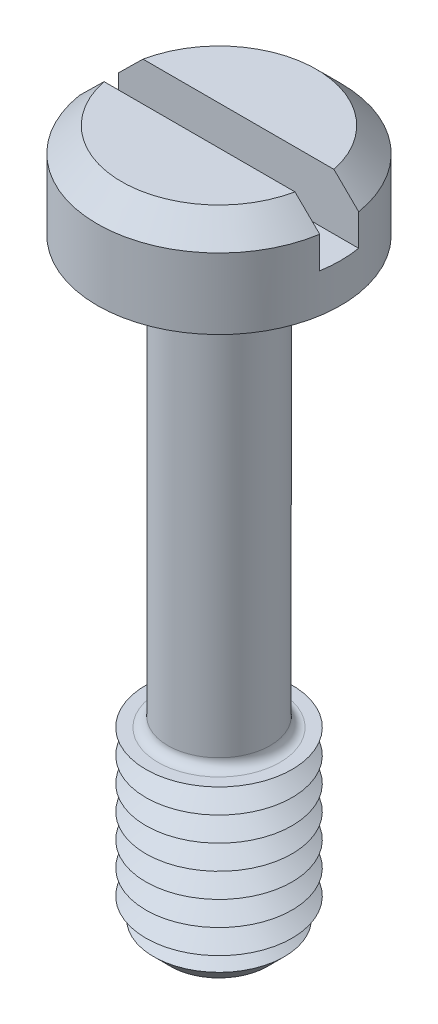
ISO-10303-21;
HEADER;
FILE_DESCRIPTION(('STEP AP214'),'2;1');
FILE_NAME('part.step','',(''),(''),'','','');
FILE_SCHEMA(('AUTOMOTIVE_DESIGN { 1 0 10303 214 1 1 1 1 }'));
ENDSEC;
DATA;
#1=APPLICATION_CONTEXT('core data for automotive mechanical design processes');
#2=APPLICATION_PROTOCOL_DEFINITION('international standard','automotive_design',2000,#1);
#3=PRODUCT_CONTEXT('',#1,'mechanical');
#4=PRODUCT('Part','Part','',(#3));
#5=PRODUCT_RELATED_PRODUCT_CATEGORY('part','',(#4));
#6=PRODUCT_DEFINITION_FORMATION('','',#4);
#7=PRODUCT_DEFINITION_CONTEXT('part definition',#1,'design');
#8=PRODUCT_DEFINITION('design','',#6,#7);
#9=PRODUCT_DEFINITION_SHAPE('','',#8);
#10=(LENGTH_UNIT() NAMED_UNIT(*) SI_UNIT(.MILLI.,.METRE.));
#11=(NAMED_UNIT(*) PLANE_ANGLE_UNIT() SI_UNIT($,.RADIAN.));
#12=(NAMED_UNIT(*) SI_UNIT($,.STERADIAN.) SOLID_ANGLE_UNIT());
#13=UNCERTAINTY_MEASURE_WITH_UNIT(LENGTH_MEASURE(1.E-05),#10,'distance_accuracy_value','');
#14=(GEOMETRIC_REPRESENTATION_CONTEXT(3) GLOBAL_UNCERTAINTY_ASSIGNED_CONTEXT((#13)) GLOBAL_UNIT_ASSIGNED_CONTEXT((#10,
#11,#12)) REPRESENTATION_CONTEXT('',''));
#15=CARTESIAN_POINT('',(0.,0.,0.));
#16=DIRECTION('',(0.,0.,1.));
#17=DIRECTION('',(1.,0.,0.));
#18=AXIS2_PLACEMENT_3D('',#15,#16,#17);
#19=CARTESIAN_POINT('',(0.,3.9,0.));
#20=DIRECTION('',(0.,1.,0.));
#21=DIRECTION('',(0.,0.,1.));
#22=AXIS2_PLACEMENT_3D('',#19,#20,#21);
#23=PLANE('',#22);
#24=DIRECTION('',(-1.,0.,0.));
#25=VECTOR('',#24,1.);
#26=CARTESIAN_POINT('',(5.,3.9,-0.8));
#27=LINE('',#26,#25);
#28=CARTESIAN_POINT('',(3.91918358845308,3.9,-0.8));
#29=VERTEX_POINT('',#28);
#30=CARTESIAN_POINT('',(-3.91918358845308,3.9,-0.8));
#31=VERTEX_POINT('',#30);
#32=EDGE_CURVE('E110',#29,#31,#27,.T.);
#33=ORIENTED_EDGE('',*,*,#32,.F.);
#34=CARTESIAN_POINT('',(0.,3.9,0.));
#35=DIRECTION('',(0.,1.,0.));
#36=DIRECTION('',(0.,0.,1.));
#37=AXIS2_PLACEMENT_3D('',#34,#35,#36);
#38=CIRCLE('',#37,4.);
#39=EDGE_CURVE('E113',#29,#31,#38,.T.);
#40=ORIENTED_EDGE('',*,*,#39,.T.);
#41=EDGE_LOOP('',(#33,#40));
#42=FACE_BOUND('',#41,.T.);
#43=ADVANCED_FACE('F39',(#42),#23,.T.);
#44=CARTESIAN_POINT('',(0.,3.9,0.));
#45=DIRECTION('',(0.,-1.,0.));
#46=DIRECTION('',(0.,0.,-1.));
#47=AXIS2_PLACEMENT_3D('',#44,#45,#46);
#48=CONICAL_SURFACE('',#47,4.,0.785398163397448);
#49=CARTESIAN_POINT('',(11.0010756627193,-3.13012537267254,-0.8));
#50=CARTESIAN_POINT('',(10.6180645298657,-2.74813121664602,-0.8));
#51=CARTESIAN_POINT('',(10.2350087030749,-2.36618183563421,-0.8));
#52=CARTESIAN_POINT('',(9.46873746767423,-1.60241986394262,-0.8));
#53=CARTESIAN_POINT('',(9.08552205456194,-1.2206072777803,-0.8));
#54=CARTESIAN_POINT('',(8.31861292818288,-0.45691870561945,-0.8));
#55=CARTESIAN_POINT('',(7.93491906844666,-0.0750428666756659,-0.8));
#56=CARTESIAN_POINT('',(7.16722555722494,0.68837857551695,-0.8));
#57=CARTESIAN_POINT('',(6.78322591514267,1.06992418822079,-0.8));
#58=CARTESIAN_POINT('',(6.01856215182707,1.82868912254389,-0.8));
#59=CARTESIAN_POINT('',(5.63790309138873,2.20591354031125,-0.8));
#60=CARTESIAN_POINT('',(5.06622054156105,2.77108317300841,-0.8));
#61=CARTESIAN_POINT('',(4.87553531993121,2.95937045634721,-0.8));
#62=CARTESIAN_POINT('',(4.49384424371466,3.33561647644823,-0.8));
#63=CARTESIAN_POINT('',(4.30283839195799,3.52357521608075,-0.8));
#64=CARTESIAN_POINT('',(3.92044271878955,3.89893397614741,-0.8));
#65=CARTESIAN_POINT('',(3.7290531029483,4.08633420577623,-0.8));
#66=CARTESIAN_POINT('',(3.34554223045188,4.46039762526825,-0.8));
#67=CARTESIAN_POINT('',(3.15342094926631,4.64706078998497,-0.8));
#68=CARTESIAN_POINT('',(2.76802565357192,5.01913697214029,-0.8));
#69=CARTESIAN_POINT('',(2.57475182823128,5.2045501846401,-0.8));
#70=CARTESIAN_POINT('',(2.28318236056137,5.48091108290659,-0.8));
#71=CARTESIAN_POINT('',(2.18571873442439,5.57273577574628,-0.8));
#72=CARTESIAN_POINT('',(1.98998431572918,5.75552004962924,-0.8));
#73=CARTESIAN_POINT('',(1.89171354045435,5.84647964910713,-0.8));
#74=CARTESIAN_POINT('',(1.76578543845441,5.96147491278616,-0.8));
#75=CARTESIAN_POINT('',(1.73869031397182,5.98612635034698,-0.8));
#76=CARTESIAN_POINT('',(1.68439529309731,6.03531372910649,-0.8));
#77=CARTESIAN_POINT('',(1.65719539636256,6.05984966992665,-0.8));
#78=CARTESIAN_POINT('',(1.57541627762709,6.13326356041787,-0.8));
#79=CARTESIAN_POINT('',(1.52066027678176,6.18194515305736,-0.8));
#80=CARTESIAN_POINT('',(1.41038257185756,6.27874171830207,-0.8));
#81=CARTESIAN_POINT('',(1.35485918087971,6.32685477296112,-0.8));
#82=CARTESIAN_POINT('',(1.24299231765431,6.42210730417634,-0.8));
#83=CARTESIAN_POINT('',(1.18664895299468,6.46924690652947,-0.8));
#84=CARTESIAN_POINT('',(1.07845249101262,6.55754663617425,-0.8));
#85=CARTESIAN_POINT('',(1.02670624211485,6.59883713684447,-0.8));
#86=CARTESIAN_POINT('',(0.921961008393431,6.67979338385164,-0.8));
#87=CARTESIAN_POINT('',(0.868962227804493,6.71945939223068,-0.8));
#88=CARTESIAN_POINT('',(0.761295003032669,6.79630361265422,-0.8));
#89=CARTESIAN_POINT('',(0.706629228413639,6.83348552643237,-0.8));
#90=CARTESIAN_POINT('',(0.594896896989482,6.90399895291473,-0.8));
#91=CARTESIAN_POINT('',(0.537833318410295,6.93733506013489,-0.8));
#92=CARTESIAN_POINT('',(0.42839047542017,6.99356340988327,-0.8));
#93=CARTESIAN_POINT('',(0.376435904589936,7.01726022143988,-0.8));
#94=CARTESIAN_POINT('',(0.269759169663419,7.05717670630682,-0.8));
#95=CARTESIAN_POINT('',(0.215046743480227,7.07342088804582,-0.8));
#96=CARTESIAN_POINT('',(0.113016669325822,7.09332110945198,-0.8));
#97=CARTESIAN_POINT('',(0.0660435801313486,7.09866042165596,-0.8));
#98=CARTESIAN_POINT('',(-0.0280587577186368,7.10088875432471,-0.8));
#99=CARTESIAN_POINT('',(-0.0751877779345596,7.09778705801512,-0.8));
#100=CARTESIAN_POINT('',(-0.180723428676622,7.08192474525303,-0.8));
#101=CARTESIAN_POINT('',(-0.238762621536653,7.06679554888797,-0.8));
#102=CARTESIAN_POINT('',(-0.32349937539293,7.03748409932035,-0.8));
#103=CARTESIAN_POINT('',(-0.351441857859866,7.02656594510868,-0.8));
#104=CARTESIAN_POINT('',(-0.406569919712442,7.00295901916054,-0.8));
#105=CARTESIAN_POINT('',(-0.433755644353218,6.99027059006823,-0.8));
#106=CARTESIAN_POINT('',(-0.5046737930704,6.95489235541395,-0.8));
#107=CARTESIAN_POINT('',(-0.547808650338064,6.93101671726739,-0.8));
#108=CARTESIAN_POINT('',(-0.632566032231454,6.88069648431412,-0.8));
#109=CARTESIAN_POINT('',(-0.674187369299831,6.85424992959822,-0.8));
#110=CARTESIAN_POINT('',(-0.756326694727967,6.79950439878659,-0.8));
#111=CARTESIAN_POINT('',(-0.796841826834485,6.77120117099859,-0.8));
#112=CARTESIAN_POINT('',(-0.876938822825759,6.7132985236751,-0.8));
#113=CARTESIAN_POINT('',(-0.916520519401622,6.68369887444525,-0.8));
#114=CARTESIAN_POINT('',(-1.03465904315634,6.59312324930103,-0.8));
#115=CARTESIAN_POINT('',(-1.11211338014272,6.53071425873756,-0.8));
#116=CARTESIAN_POINT('',(-1.26505454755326,6.4038141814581,-0.8));
#117=CARTESIAN_POINT('',(-1.34054439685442,6.33932667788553,-0.8));
#118=CARTESIAN_POINT('',(-1.48913173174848,6.20997083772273,-0.8));
#119=CARTESIAN_POINT('',(-1.56224816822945,6.14512422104,-0.8));
#120=CARTESIAN_POINT('',(-1.70765393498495,6.01451044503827,-0.8));
#121=CARTESIAN_POINT('',(-1.77994324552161,5.94874326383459,-0.8));
#122=CARTESIAN_POINT('',(-1.99594639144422,5.7504659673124,-0.8));
#123=CARTESIAN_POINT('',(-2.13877767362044,5.61699583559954,-0.8));
#124=CARTESIAN_POINT('',(-2.42324632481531,5.34853800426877,-0.8));
#125=CARTESIAN_POINT('',(-2.56488247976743,5.21354902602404,-0.8));
#126=CARTESIAN_POINT('',(-2.8473092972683,4.94270932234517,-0.8));
#127=CARTESIAN_POINT('',(-2.98810001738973,4.80685865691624,-0.8));
#128=CARTESIAN_POINT('',(-3.26818763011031,4.5354997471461,-0.8));
#129=CARTESIAN_POINT('',(-3.40748821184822,4.39999530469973,-0.8));
#130=CARTESIAN_POINT('',(-3.68570899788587,4.12859172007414,-0.8));
#131=CARTESIAN_POINT('',(-3.82462919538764,3.99269257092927,-0.8));
#132=CARTESIAN_POINT('',(-4.24087543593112,3.58468153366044,-0.8));
#133=CARTESIAN_POINT('',(-4.51779300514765,3.31215310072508,-0.8));
#134=CARTESIAN_POINT('',(-5.05279381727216,2.78443938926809,-0.8));
#135=CARTESIAN_POINT('',(-5.31091639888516,2.52929393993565,-0.8));
#136=CARTESIAN_POINT('',(-5.82680751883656,2.01864429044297,-0.8));
#137=CARTESIAN_POINT('',(-6.08457605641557,1.76314008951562,-0.8));
#138=CARTESIAN_POINT('',(-6.85760508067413,0.996194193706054,-0.8));
#139=CARTESIAN_POINT('',(-7.37251152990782,0.484395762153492,-0.8));
#140=CARTESIAN_POINT('',(-8.40657233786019,-0.544392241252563,-0.8));
#141=CARTESIAN_POINT('',(-8.92572224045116,-1.06138628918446,-0.8));
#142=CARTESIAN_POINT('',(-9.96362871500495,-2.09560660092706,-0.8));
#143=CARTESIAN_POINT('',(-10.4823853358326,-2.61283281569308,-0.8));
#144=CARTESIAN_POINT('',(-11.0010756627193,-3.13012537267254,-0.8));
#145=B_SPLINE_CURVE_WITH_KNOTS('',3,(#49,#50,#51,#52,#53,#54,#55,#56,#57,#58,#59,#60,#61,#62,
#63,#64,#65,#66,#67,#68,#69,#70,#71,#72,#73,#74,#75,#76,#77,#78,#79,#80,#81,#82,#83,#84,#85,#86,
#87,#88,#89,#90,#91,#92,#93,#94,#95,#96,#97,#98,#99,#100,#101,#102,#103,#104,#105,#106,#107,
#108,#109,#110,#111,#112,#113,#114,#115,#116,#117,#118,#119,#120,#121,#122,#123,#124,#125,#126,
#127,#128,#129,#130,#131,#132,#133,#134,#135,#136,#137,#138,#139,#140,#141,#142,#143,#144),
.UNSPECIFIED.,.F.,.F.,(4,2,2,2,2,2,2,2,2,2,2,2,2,2,2,2,2,2,2,2,2,2,2,2,2,2,2,2,2,2,2,2,2,2,2,2,
2,2,2,2,2,2,2,2,2,2,2,4),(0.,1.62282275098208,3.2456948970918,4.869717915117,6.49369278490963,
8.10142191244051,8.90535980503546,9.70929063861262,10.5128682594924,11.3164730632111,
12.1199494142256,12.5216659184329,12.9233738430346,13.0332669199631,13.1431603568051,
13.3629580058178,13.5833578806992,13.8037290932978,14.0023112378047,14.2008612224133,
14.3991084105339,14.5971162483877,14.7680800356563,14.9384774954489,15.0795987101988,
15.2205647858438,15.3993585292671,15.4893211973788,15.5792664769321,15.727032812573,
15.8749126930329,16.0231439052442,16.1714014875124,16.4697244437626,16.7675580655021,
17.0607348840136,17.3539186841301,17.9403574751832,18.5273336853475,19.1142694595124,
19.6972736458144,20.2802881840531,21.4458742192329,22.5346981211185,23.6235243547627,
25.8015035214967,27.9995014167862,30.1971550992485),.UNSPECIFIED.);
#146=CARTESIAN_POINT('',(4.93558507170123,2.9,-0.8));
#147=VERTEX_POINT('',#146);
#148=EDGE_CURVE('E252',#147,#29,#145,.T.);
#149=ORIENTED_EDGE('',*,*,#148,.F.);
#150=CARTESIAN_POINT('',(0.,2.9,0.));
#151=DIRECTION('',(0.,1.,0.));
#152=DIRECTION('',(0.,0.,1.));
#153=AXIS2_PLACEMENT_3D('',#150,#151,#152);
#154=CIRCLE('',#153,5.);
#155=CARTESIAN_POINT('',(-4.93558507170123,2.9,-0.8));
#156=VERTEX_POINT('',#155);
#157=EDGE_CURVE('E128',#156,#147,#154,.F.);
#158=ORIENTED_EDGE('',*,*,#157,.F.);
#159=EDGE_CURVE('E102',#31,#156,#145,.T.);
#160=ORIENTED_EDGE('',*,*,#159,.F.);
#161=ORIENTED_EDGE('',*,*,#39,.F.);
#162=EDGE_LOOP('',(#149,#158,#160,#161));
#163=FACE_BOUND('',#162,.T.);
#164=ADVANCED_FACE('F214',(#163),#48,.T.);
#165=CARTESIAN_POINT('',(0.,-25.,0.));
#166=DIRECTION('',(0.,1.,0.));
#167=DIRECTION('',(0.,0.,1.));
#168=AXIS2_PLACEMENT_3D('',#165,#166,#167);
#169=CYLINDRICAL_SURFACE('',#168,2.1);
#170=CARTESIAN_POINT('',(0.,-17.1,0.));
#171=DIRECTION('',(0.,-1.,0.));
#172=DIRECTION('',(0.,0.,-1.));
#173=AXIS2_PLACEMENT_3D('',#170,#171,#172);
#174=CIRCLE('',#173,2.1);
#175=CARTESIAN_POINT('',(0.,-17.1,-2.1));
#176=VERTEX_POINT('',#175);
#177=EDGE_CURVE('E123',#176,#176,#174,.F.);
#178=ORIENTED_EDGE('',*,*,#177,.T.);
#179=EDGE_LOOP('',(#178));
#180=FACE_BOUND('',#179,.T.);
#181=CARTESIAN_POINT('',(0.,-0.400000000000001,0.));
#182=DIRECTION('',(0.,1.,0.));
#183=DIRECTION('',(0.,0.,1.));
#184=AXIS2_PLACEMENT_3D('',#181,#182,#183);
#185=CIRCLE('',#184,2.1);
#186=CARTESIAN_POINT('',(0.,-0.400000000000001,2.1));
#187=VERTEX_POINT('',#186);
#188=EDGE_CURVE('E349',#187,#187,#185,.F.);
#189=ORIENTED_EDGE('',*,*,#188,.T.);
#190=EDGE_LOOP('',(#189));
#191=FACE_BOUND('',#190,.T.);
#192=ADVANCED_FACE('F210',(#180,#191),#169,.T.);
#193=CARTESIAN_POINT('',(0.,3.9,0.));
#194=DIRECTION('',(0.,-1.,0.));
#195=DIRECTION('',(0.,0.,-1.));
#196=AXIS2_PLACEMENT_3D('',#193,#194,#195);
#197=CYLINDRICAL_SURFACE('',#196,5.);
#198=ORIENTED_EDGE('',*,*,#157,.T.);
#199=DIRECTION('',(0.,-1.,0.));
#200=VECTOR('',#199,1.);
#201=CARTESIAN_POINT('',(4.93558507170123,3.9,-0.8));
#202=LINE('',#201,#200);
#203=CARTESIAN_POINT('',(4.93558507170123,1.6,-0.8));
#204=VERTEX_POINT('',#203);
#205=EDGE_CURVE('E64',#147,#204,#202,.T.);
#206=ORIENTED_EDGE('',*,*,#205,.T.);
#207=CARTESIAN_POINT('',(0.,1.6,0.));
#208=DIRECTION('',(0.,1.,0.));
#209=DIRECTION('',(0.,0.,1.));
#210=AXIS2_PLACEMENT_3D('',#207,#208,#209);
#211=CIRCLE('',#210,5.);
#212=CARTESIAN_POINT('',(4.93558507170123,1.6,0.8));
#213=VERTEX_POINT('',#212);
#214=EDGE_CURVE('E11',#213,#204,#211,.T.);
#215=ORIENTED_EDGE('',*,*,#214,.F.);
#216=DIRECTION('',(0.,-1.,0.));
#217=VECTOR('',#216,1.);
#218=CARTESIAN_POINT('',(4.93558507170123,3.9,0.8));
#219=LINE('',#218,#217);
#220=CARTESIAN_POINT('',(4.93558507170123,2.9,0.8));
#221=VERTEX_POINT('',#220);
#222=EDGE_CURVE('E269',#213,#221,#219,.F.);
#223=ORIENTED_EDGE('',*,*,#222,.T.);
#224=CARTESIAN_POINT('',(-4.93558507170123,2.9,0.8));
#225=VERTEX_POINT('',#224);
#226=EDGE_CURVE('E120',#221,#225,#154,.F.);
#227=ORIENTED_EDGE('',*,*,#226,.T.);
#228=DIRECTION('',(0.,-1.,0.));
#229=VECTOR('',#228,1.);
#230=CARTESIAN_POINT('',(-4.93558507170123,3.9,0.8));
#231=LINE('',#230,#229);
#232=CARTESIAN_POINT('',(-4.93558507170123,1.6,0.8));
#233=VERTEX_POINT('',#232);
#234=EDGE_CURVE('E96',#225,#233,#231,.T.);
#235=ORIENTED_EDGE('',*,*,#234,.T.);
#236=CARTESIAN_POINT('',(-4.93558507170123,1.6,-0.8));
#237=VERTEX_POINT('',#236);
#238=EDGE_CURVE('E44',#237,#233,#211,.T.);
#239=ORIENTED_EDGE('',*,*,#238,.F.);
#240=DIRECTION('',(0.,-1.,0.));
#241=VECTOR('',#240,1.);
#242=CARTESIAN_POINT('',(-4.93558507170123,3.9,-0.8));
#243=LINE('',#242,#241);
#244=EDGE_CURVE('E274',#237,#156,#243,.F.);
#245=ORIENTED_EDGE('',*,*,#244,.T.);
#246=EDGE_LOOP('',(#198,#206,#215,#223,#227,#235,#239,#245));
#247=FACE_BOUND('',#246,.T.);
#248=CARTESIAN_POINT('',(0.,0.,0.));
#249=DIRECTION('',(0.,1.,0.));
#250=DIRECTION('',(0.,0.,1.));
#251=AXIS2_PLACEMENT_3D('',#248,#249,#250);
#252=CIRCLE('',#251,5.);
#253=CARTESIAN_POINT('',(0.,0.,5.));
#254=VERTEX_POINT('',#253);
#255=EDGE_CURVE('E334',#254,#254,#252,.T.);
#256=ORIENTED_EDGE('',*,*,#255,.T.);
#257=EDGE_LOOP('',(#256));
#258=FACE_BOUND('',#257,.T.);
#259=ADVANCED_FACE('F213',(#247,#258),#197,.T.);
#260=DIRECTION('',(1.,0.,0.));
#261=VECTOR('',#260,1.);
#262=CARTESIAN_POINT('',(5.,3.9,0.8));
#263=LINE('',#262,#261);
#264=CARTESIAN_POINT('',(-3.91918358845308,3.9,0.8));
#265=VERTEX_POINT('',#264);
#266=CARTESIAN_POINT('',(3.91918358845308,3.9,0.8));
#267=VERTEX_POINT('',#266);
#268=EDGE_CURVE('E56',#265,#267,#263,.T.);
#269=ORIENTED_EDGE('',*,*,#268,.F.);
#270=EDGE_CURVE('E108',#265,#267,#38,.T.);
#271=ORIENTED_EDGE('',*,*,#270,.T.);
#272=EDGE_LOOP('',(#269,#271));
#273=FACE_BOUND('',#272,.T.);
#274=ADVANCED_FACE('F107',(#273),#23,.T.);
#275=CARTESIAN_POINT('',(0.,0.,0.));
#276=DIRECTION('',(0.,1.,0.));
#277=DIRECTION('',(0.,0.,1.));
#278=AXIS2_PLACEMENT_3D('',#275,#276,#277);
#279=PLANE('',#278);
#280=CARTESIAN_POINT('',(0.,0.,0.));
#281=DIRECTION('',(0.,1.,0.));
#282=DIRECTION('',(0.,0.,1.));
#283=AXIS2_PLACEMENT_3D('',#280,#281,#282);
#284=CIRCLE('',#283,2.5);
#285=CARTESIAN_POINT('',(0.,0.,2.5));
#286=VERTEX_POINT('',#285);
#287=EDGE_CURVE('E114',#286,#286,#284,.T.);
#288=ORIENTED_EDGE('',*,*,#287,.T.);
#289=EDGE_LOOP('',(#288));
#290=FACE_BOUND('',#289,.T.);
#291=ORIENTED_EDGE('',*,*,#255,.F.);
#292=EDGE_LOOP('',(#291));
#293=FACE_BOUND('',#292,.T.);
#294=ADVANCED_FACE('F204',(#290,#293),#279,.F.);
#295=CARTESIAN_POINT('',(0.,-17.5,0.));
#296=DIRECTION('',(0.,-1.,0.));
#297=DIRECTION('',(0.,0.,-1.));
#298=AXIS2_PLACEMENT_3D('',#295,#296,#297);
#299=PLANE('',#298);
#300=CARTESIAN_POINT('',(0.,-17.5,0.));
#301=DIRECTION('',(0.,-1.,0.));
#302=DIRECTION('',(0.,0.,-1.));
#303=AXIS2_PLACEMENT_3D('',#300,#301,#302);
#304=CIRCLE('',#303,2.5);
#305=CARTESIAN_POINT('',(0.,-17.5,-2.5));
#306=VERTEX_POINT('',#305);
#307=EDGE_CURVE('E342',#306,#306,#304,.T.);
#308=ORIENTED_EDGE('',*,*,#307,.T.);
#309=EDGE_LOOP('',(#308));
#310=FACE_BOUND('',#309,.T.);
#311=CARTESIAN_POINT('',(0.,-17.5,0.));
#312=DIRECTION('',(0.,1.,0.));
#313=DIRECTION('',(0.,0.,1.));
#314=AXIS2_PLACEMENT_3D('',#311,#312,#313);
#315=CIRCLE('',#314,3.);
#316=CARTESIAN_POINT('',(0.,-17.5,3.));
#317=VERTEX_POINT('',#316);
#318=EDGE_CURVE('E331',#317,#317,#315,.T.);
#319=ORIENTED_EDGE('',*,*,#318,.T.);
#320=EDGE_LOOP('',(#319));
#321=FACE_BOUND('',#320,.T.);
#322=ADVANCED_FACE('F200',(#310,#321),#299,.F.);
#323=CARTESIAN_POINT('',(0.,-18.,0.));
#324=DIRECTION('',(0.,1.,0.));
#325=DIRECTION('',(0.,0.,1.));
#326=AXIS2_PLACEMENT_3D('',#323,#324,#325);
#327=CONICAL_SURFACE('',#326,2.13397459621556,1.0471975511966);
#328=ORIENTED_EDGE('',*,*,#318,.F.);
#329=EDGE_LOOP('',(#328));
#330=FACE_BOUND('',#329,.T.);
#331=CARTESIAN_POINT('',(0.,-18.,0.));
#332=DIRECTION('',(0.,1.,0.));
#333=DIRECTION('',(0.,0.,1.));
#334=AXIS2_PLACEMENT_3D('',#331,#332,#333);
#335=CIRCLE('',#334,2.13397459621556);
#336=CARTESIAN_POINT('',(0.,-18.,2.13397459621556));
#337=VERTEX_POINT('',#336);
#338=EDGE_CURVE('E327',#337,#337,#335,.T.);
#339=ORIENTED_EDGE('',*,*,#338,.T.);
#340=EDGE_LOOP('',(#339));
#341=FACE_BOUND('',#340,.T.);
#342=ADVANCED_FACE('F196',(#330,#341),#327,.T.);
#343=CARTESIAN_POINT('',(0.,-18.5,0.));
#344=DIRECTION('',(0.,-1.,0.));
#345=DIRECTION('',(0.,0.,-1.));
#346=AXIS2_PLACEMENT_3D('',#343,#344,#345);
#347=CONICAL_SURFACE('',#346,3.,1.0471975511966);
#348=ORIENTED_EDGE('',*,*,#338,.F.);
#349=EDGE_LOOP('',(#348));
#350=FACE_BOUND('',#349,.T.);
#351=CARTESIAN_POINT('',(0.,-18.5,0.));
#352=DIRECTION('',(0.,1.,0.));
#353=DIRECTION('',(0.,0.,1.));
#354=AXIS2_PLACEMENT_3D('',#351,#352,#353);
#355=CIRCLE('',#354,3.);
#356=CARTESIAN_POINT('',(0.,-18.5,3.));
#357=VERTEX_POINT('',#356);
#358=EDGE_CURVE('E324',#357,#357,#355,.T.);
#359=ORIENTED_EDGE('',*,*,#358,.T.);
#360=EDGE_LOOP('',(#359));
#361=FACE_BOUND('',#360,.T.);
#362=ADVANCED_FACE('F192',(#350,#361),#347,.T.);
#363=CARTESIAN_POINT('',(0.,-19.,0.));
#364=DIRECTION('',(0.,1.,0.));
#365=DIRECTION('',(0.,0.,1.));
#366=AXIS2_PLACEMENT_3D('',#363,#364,#365);
#367=CONICAL_SURFACE('',#366,2.13397459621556,1.0471975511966);
#368=ORIENTED_EDGE('',*,*,#358,.F.);
#369=EDGE_LOOP('',(#368));
#370=FACE_BOUND('',#369,.T.);
#371=CARTESIAN_POINT('',(0.,-19.,0.));
#372=DIRECTION('',(0.,1.,0.));
#373=DIRECTION('',(0.,0.,1.));
#374=AXIS2_PLACEMENT_3D('',#371,#372,#373);
#375=CIRCLE('',#374,2.13397459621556);
#376=CARTESIAN_POINT('',(0.,-19.,2.13397459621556));
#377=VERTEX_POINT('',#376);
#378=EDGE_CURVE('E320',#377,#377,#375,.T.);
#379=ORIENTED_EDGE('',*,*,#378,.T.);
#380=EDGE_LOOP('',(#379));
#381=FACE_BOUND('',#380,.T.);
#382=ADVANCED_FACE('F188',(#370,#381),#367,.T.);
#383=CARTESIAN_POINT('',(0.,-19.5,0.));
#384=DIRECTION('',(0.,-1.,0.));
#385=DIRECTION('',(0.,0.,-1.));
#386=AXIS2_PLACEMENT_3D('',#383,#384,#385);
#387=CONICAL_SURFACE('',#386,3.,1.0471975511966);
#388=ORIENTED_EDGE('',*,*,#378,.F.);
#389=EDGE_LOOP('',(#388));
#390=FACE_BOUND('',#389,.T.);
#391=CARTESIAN_POINT('',(0.,-19.5,0.));
#392=DIRECTION('',(0.,1.,0.));
#393=DIRECTION('',(0.,0.,1.));
#394=AXIS2_PLACEMENT_3D('',#391,#392,#393);
#395=CIRCLE('',#394,3.);
#396=CARTESIAN_POINT('',(0.,-19.5,3.));
#397=VERTEX_POINT('',#396);
#398=EDGE_CURVE('E316',#397,#397,#395,.T.);
#399=ORIENTED_EDGE('',*,*,#398,.T.);
#400=EDGE_LOOP('',(#399));
#401=FACE_BOUND('',#400,.T.);
#402=ADVANCED_FACE('F184',(#390,#401),#387,.T.);
#403=CARTESIAN_POINT('',(0.,-20.,0.));
#404=DIRECTION('',(0.,1.,0.));
#405=DIRECTION('',(0.,0.,1.));
#406=AXIS2_PLACEMENT_3D('',#403,#404,#405);
#407=CONICAL_SURFACE('',#406,2.13397459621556,1.0471975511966);
#408=ORIENTED_EDGE('',*,*,#398,.F.);
#409=EDGE_LOOP('',(#408));
#410=FACE_BOUND('',#409,.T.);
#411=CARTESIAN_POINT('',(0.,-20.,0.));
#412=DIRECTION('',(0.,1.,0.));
#413=DIRECTION('',(0.,0.,1.));
#414=AXIS2_PLACEMENT_3D('',#411,#412,#413);
#415=CIRCLE('',#414,2.13397459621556);
#416=CARTESIAN_POINT('',(0.,-20.,2.13397459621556));
#417=VERTEX_POINT('',#416);
#418=EDGE_CURVE('E313',#417,#417,#415,.T.);
#419=ORIENTED_EDGE('',*,*,#418,.T.);
#420=EDGE_LOOP('',(#419));
#421=FACE_BOUND('',#420,.T.);
#422=ADVANCED_FACE('F180',(#410,#421),#407,.T.);
#423=CARTESIAN_POINT('',(0.,-20.5,0.));
#424=DIRECTION('',(0.,-1.,0.));
#425=DIRECTION('',(0.,0.,-1.));
#426=AXIS2_PLACEMENT_3D('',#423,#424,#425);
#427=CONICAL_SURFACE('',#426,3.,1.0471975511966);
#428=ORIENTED_EDGE('',*,*,#418,.F.);
#429=EDGE_LOOP('',(#428));
#430=FACE_BOUND('',#429,.T.);
#431=CARTESIAN_POINT('',(0.,-20.5,0.));
#432=DIRECTION('',(0.,1.,0.));
#433=DIRECTION('',(0.,0.,1.));
#434=AXIS2_PLACEMENT_3D('',#431,#432,#433);
#435=CIRCLE('',#434,3.);
#436=CARTESIAN_POINT('',(0.,-20.5,3.));
#437=VERTEX_POINT('',#436);
#438=EDGE_CURVE('E309',#437,#437,#435,.T.);
#439=ORIENTED_EDGE('',*,*,#438,.T.);
#440=EDGE_LOOP('',(#439));
#441=FACE_BOUND('',#440,.T.);
#442=ADVANCED_FACE('F176',(#430,#441),#427,.T.);
#443=CARTESIAN_POINT('',(0.,-21.,0.));
#444=DIRECTION('',(0.,1.,0.));
#445=DIRECTION('',(0.,0.,1.));
#446=AXIS2_PLACEMENT_3D('',#443,#444,#445);
#447=CONICAL_SURFACE('',#446,2.13397459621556,1.0471975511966);
#448=ORIENTED_EDGE('',*,*,#438,.F.);
#449=EDGE_LOOP('',(#448));
#450=FACE_BOUND('',#449,.T.);
#451=CARTESIAN_POINT('',(0.,-21.,0.));
#452=DIRECTION('',(0.,1.,0.));
#453=DIRECTION('',(0.,0.,1.));
#454=AXIS2_PLACEMENT_3D('',#451,#452,#453);
#455=CIRCLE('',#454,2.13397459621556);
#456=CARTESIAN_POINT('',(0.,-21.,2.13397459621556));
#457=VERTEX_POINT('',#456);
#458=EDGE_CURVE('E306',#457,#457,#455,.T.);
#459=ORIENTED_EDGE('',*,*,#458,.T.);
#460=EDGE_LOOP('',(#459));
#461=FACE_BOUND('',#460,.T.);
#462=ADVANCED_FACE('F172',(#450,#461),#447,.T.);
#463=CARTESIAN_POINT('',(0.,-21.5,0.));
#464=DIRECTION('',(0.,-1.,0.));
#465=DIRECTION('',(0.,0.,-1.));
#466=AXIS2_PLACEMENT_3D('',#463,#464,#465);
#467=CONICAL_SURFACE('',#466,3.,1.0471975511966);
#468=ORIENTED_EDGE('',*,*,#458,.F.);
#469=EDGE_LOOP('',(#468));
#470=FACE_BOUND('',#469,.T.);
#471=CARTESIAN_POINT('',(0.,-21.5,0.));
#472=DIRECTION('',(0.,1.,0.));
#473=DIRECTION('',(0.,0.,1.));
#474=AXIS2_PLACEMENT_3D('',#471,#472,#473);
#475=CIRCLE('',#474,3.);
#476=CARTESIAN_POINT('',(0.,-21.5,3.));
#477=VERTEX_POINT('',#476);
#478=EDGE_CURVE('E302',#477,#477,#475,.T.);
#479=ORIENTED_EDGE('',*,*,#478,.T.);
#480=EDGE_LOOP('',(#479));
#481=FACE_BOUND('',#480,.T.);
#482=ADVANCED_FACE('F168',(#470,#481),#467,.T.);
#483=CARTESIAN_POINT('',(0.,-22.,0.));
#484=DIRECTION('',(0.,1.,0.));
#485=DIRECTION('',(0.,0.,1.));
#486=AXIS2_PLACEMENT_3D('',#483,#484,#485);
#487=CONICAL_SURFACE('',#486,2.13397459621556,1.0471975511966);
#488=ORIENTED_EDGE('',*,*,#478,.F.);
#489=EDGE_LOOP('',(#488));
#490=FACE_BOUND('',#489,.T.);
#491=CARTESIAN_POINT('',(0.,-22.,0.));
#492=DIRECTION('',(0.,1.,0.));
#493=DIRECTION('',(0.,0.,1.));
#494=AXIS2_PLACEMENT_3D('',#491,#492,#493);
#495=CIRCLE('',#494,2.13397459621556);
#496=CARTESIAN_POINT('',(0.,-22.,2.13397459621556));
#497=VERTEX_POINT('',#496);
#498=EDGE_CURVE('E298',#497,#497,#495,.T.);
#499=ORIENTED_EDGE('',*,*,#498,.T.);
#500=EDGE_LOOP('',(#499));
#501=FACE_BOUND('',#500,.T.);
#502=ADVANCED_FACE('F164',(#490,#501),#487,.T.);
#503=CARTESIAN_POINT('',(0.,-22.5,0.));
#504=DIRECTION('',(0.,-1.,0.));
#505=DIRECTION('',(0.,0.,-1.));
#506=AXIS2_PLACEMENT_3D('',#503,#504,#505);
#507=CONICAL_SURFACE('',#506,3.,1.0471975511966);
#508=ORIENTED_EDGE('',*,*,#498,.F.);
#509=EDGE_LOOP('',(#508));
#510=FACE_BOUND('',#509,.T.);
#511=CARTESIAN_POINT('',(0.,-22.5,0.));
#512=DIRECTION('',(0.,1.,0.));
#513=DIRECTION('',(0.,0.,1.));
#514=AXIS2_PLACEMENT_3D('',#511,#512,#513);
#515=CIRCLE('',#514,3.);
#516=CARTESIAN_POINT('',(0.,-22.5,3.));
#517=VERTEX_POINT('',#516);
#518=EDGE_CURVE('E294',#517,#517,#515,.T.);
#519=ORIENTED_EDGE('',*,*,#518,.T.);
#520=EDGE_LOOP('',(#519));
#521=FACE_BOUND('',#520,.T.);
#522=ADVANCED_FACE('F160',(#510,#521),#507,.T.);
#523=CARTESIAN_POINT('',(0.,-23.,0.));
#524=DIRECTION('',(0.,1.,0.));
#525=DIRECTION('',(0.,0.,1.));
#526=AXIS2_PLACEMENT_3D('',#523,#524,#525);
#527=CONICAL_SURFACE('',#526,2.13397459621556,1.0471975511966);
#528=ORIENTED_EDGE('',*,*,#518,.F.);
#529=EDGE_LOOP('',(#528));
#530=FACE_BOUND('',#529,.T.);
#531=CARTESIAN_POINT('',(0.,-23.,0.));
#532=DIRECTION('',(0.,1.,0.));
#533=DIRECTION('',(0.,0.,1.));
#534=AXIS2_PLACEMENT_3D('',#531,#532,#533);
#535=CIRCLE('',#534,2.13397459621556);
#536=CARTESIAN_POINT('',(0.,-23.,2.13397459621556));
#537=VERTEX_POINT('',#536);
#538=EDGE_CURVE('E290',#537,#537,#535,.T.);
#539=ORIENTED_EDGE('',*,*,#538,.T.);
#540=EDGE_LOOP('',(#539));
#541=FACE_BOUND('',#540,.T.);
#542=ADVANCED_FACE('F156',(#530,#541),#527,.T.);
#543=CARTESIAN_POINT('',(0.,-23.5,0.));
#544=DIRECTION('',(0.,-1.,0.));
#545=DIRECTION('',(0.,0.,-1.));
#546=AXIS2_PLACEMENT_3D('',#543,#544,#545);
#547=CONICAL_SURFACE('',#546,3.,1.0471975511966);
#548=ORIENTED_EDGE('',*,*,#538,.F.);
#549=EDGE_LOOP('',(#548));
#550=FACE_BOUND('',#549,.T.);
#551=CARTESIAN_POINT('',(0.,-23.5,0.));
#552=DIRECTION('',(0.,1.,0.));
#553=DIRECTION('',(0.,0.,1.));
#554=AXIS2_PLACEMENT_3D('',#551,#552,#553);
#555=CIRCLE('',#554,3.);
#556=CARTESIAN_POINT('',(0.,-23.5,3.));
#557=VERTEX_POINT('',#556);
#558=EDGE_CURVE('E285',#557,#557,#555,.T.);
#559=ORIENTED_EDGE('',*,*,#558,.T.);
#560=EDGE_LOOP('',(#559));
#561=FACE_BOUND('',#560,.T.);
#562=ADVANCED_FACE('F152',(#550,#561),#547,.T.);
#563=CARTESIAN_POINT('',(0.,-24.,0.));
#564=DIRECTION('',(0.,1.,0.));
#565=DIRECTION('',(0.,0.,1.));
#566=AXIS2_PLACEMENT_3D('',#563,#564,#565);
#567=CONICAL_SURFACE('',#566,2.13397459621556,1.0471975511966);
#568=ORIENTED_EDGE('',*,*,#558,.F.);
#569=EDGE_LOOP('',(#568));
#570=FACE_BOUND('',#569,.T.);
#571=CARTESIAN_POINT('',(0.,-24.,0.));
#572=DIRECTION('',(0.,1.,0.));
#573=DIRECTION('',(0.,0.,1.));
#574=AXIS2_PLACEMENT_3D('',#571,#572,#573);
#575=CIRCLE('',#574,2.13397459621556);
#576=CARTESIAN_POINT('',(0.,-24.,2.13397459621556));
#577=VERTEX_POINT('',#576);
#578=EDGE_CURVE('E282',#577,#577,#575,.T.);
#579=ORIENTED_EDGE('',*,*,#578,.T.);
#580=EDGE_LOOP('',(#579));
#581=FACE_BOUND('',#580,.T.);
#582=ADVANCED_FACE('F148',(#570,#581),#567,.T.);
#583=CARTESIAN_POINT('',(0.,-24.5,0.));
#584=DIRECTION('',(0.,-1.,0.));
#585=DIRECTION('',(0.,0.,-1.));
#586=AXIS2_PLACEMENT_3D('',#583,#584,#585);
#587=CONICAL_SURFACE('',#586,3.,1.0471975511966);
#588=CARTESIAN_POINT('',(0.,-24.3169872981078,0.));
#589=DIRECTION('',(0.,-1.,0.));
#590=DIRECTION('',(0.,0.,-1.));
#591=AXIS2_PLACEMENT_3D('',#588,#589,#590);
#592=CIRCLE('',#591,2.68301270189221);
#593=CARTESIAN_POINT('',(0.,-24.3169872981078,-2.68301270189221));
#594=VERTEX_POINT('',#593);
#595=EDGE_CURVE('E289',#594,#594,#592,.F.);
#596=ORIENTED_EDGE('',*,*,#595,.T.);
#597=EDGE_LOOP('',(#596));
#598=FACE_BOUND('',#597,.T.);
#599=ORIENTED_EDGE('',*,*,#578,.F.);
#600=EDGE_LOOP('',(#599));
#601=FACE_BOUND('',#600,.T.);
#602=ADVANCED_FACE('F144',(#598,#601),#587,.T.);
#603=CARTESIAN_POINT('',(0.,-25.,0.));
#604=DIRECTION('',(0.,-1.,0.));
#605=DIRECTION('',(0.,0.,-1.));
#606=AXIS2_PLACEMENT_3D('',#603,#604,#605);
#607=PLANE('',#606);
#608=CARTESIAN_POINT('',(0.,-25.,0.));
#609=DIRECTION('',(0.,-1.,0.));
#610=DIRECTION('',(0.,0.,-1.));
#611=AXIS2_PLACEMENT_3D('',#608,#609,#610);
#612=CIRCLE('',#611,1.99999999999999);
#613=CARTESIAN_POINT('',(0.,-25.,-1.99999999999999));
#614=VERTEX_POINT('',#613);
#615=EDGE_CURVE('E338',#614,#614,#612,.T.);
#616=ORIENTED_EDGE('',*,*,#615,.T.);
#617=EDGE_LOOP('',(#616));
#618=FACE_BOUND('',#617,.T.);
#619=ADVANCED_FACE('F147',(#618),#607,.T.);
#620=CARTESIAN_POINT('',(0.,-25.,0.));
#621=DIRECTION('',(0.,1.,0.));
#622=DIRECTION('',(0.,0.,1.));
#623=AXIS2_PLACEMENT_3D('',#620,#621,#622);
#624=CONICAL_SURFACE('',#623,1.99999999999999,0.785398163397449);
#625=ORIENTED_EDGE('',*,*,#595,.F.);
#626=EDGE_LOOP('',(#625));
#627=FACE_BOUND('',#626,.T.);
#628=ORIENTED_EDGE('',*,*,#615,.F.);
#629=EDGE_LOOP('',(#628));
#630=FACE_BOUND('',#629,.T.);
#631=ADVANCED_FACE('F208',(#627,#630),#624,.T.);
#632=CARTESIAN_POINT('',(0.,-17.1,0.));
#633=DIRECTION('',(0.,-1.,0.));
#634=DIRECTION('',(0.,0.,-1.));
#635=AXIS2_PLACEMENT_3D('',#632,#633,#634);
#636=TOROIDAL_SURFACE('',#635,2.5,0.4);
#637=ORIENTED_EDGE('',*,*,#177,.F.);
#638=EDGE_LOOP('',(#637));
#639=FACE_BOUND('',#638,.T.);
#640=ORIENTED_EDGE('',*,*,#307,.F.);
#641=EDGE_LOOP('',(#640));
#642=FACE_BOUND('',#641,.T.);
#643=ADVANCED_FACE('F226',(#639,#642),#636,.F.);
#644=CARTESIAN_POINT('',(0.,-0.400000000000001,0.));
#645=DIRECTION('',(0.,1.,0.));
#646=DIRECTION('',(0.,0.,1.));
#647=AXIS2_PLACEMENT_3D('',#644,#645,#646);
#648=TOROIDAL_SURFACE('',#647,2.5,0.4);
#649=ORIENTED_EDGE('',*,*,#287,.F.);
#650=EDGE_LOOP('',(#649));
#651=FACE_BOUND('',#650,.T.);
#652=ORIENTED_EDGE('',*,*,#188,.F.);
#653=EDGE_LOOP('',(#652));
#654=FACE_BOUND('',#653,.T.);
#655=ADVANCED_FACE('F229',(#651,#654),#648,.F.);
#656=CARTESIAN_POINT('',(-11.0010756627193,-3.13012537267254,0.8));
#657=CARTESIAN_POINT('',(-10.6180645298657,-2.74813121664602,0.8));
#658=CARTESIAN_POINT('',(-10.2350087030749,-2.36618183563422,0.8));
#659=CARTESIAN_POINT('',(-9.46873746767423,-1.60241986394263,0.8));
#660=CARTESIAN_POINT('',(-9.08552205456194,-1.2206072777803,0.8));
#661=CARTESIAN_POINT('',(-8.31861292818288,-0.456918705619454,0.8));
#662=CARTESIAN_POINT('',(-7.93491906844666,-0.0750428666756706,0.8));
#663=CARTESIAN_POINT('',(-7.16722555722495,0.688378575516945,0.8));
#664=CARTESIAN_POINT('',(-6.78322591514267,1.06992418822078,0.8));
#665=CARTESIAN_POINT('',(-6.01856215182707,1.82868912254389,0.8));
#666=CARTESIAN_POINT('',(-5.63790309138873,2.20591354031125,0.8));
#667=CARTESIAN_POINT('',(-5.06622054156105,2.77108317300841,0.8));
#668=CARTESIAN_POINT('',(-4.87553531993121,2.95937045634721,0.8));
#669=CARTESIAN_POINT('',(-4.49384424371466,3.33561647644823,0.8));
#670=CARTESIAN_POINT('',(-4.302838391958,3.52357521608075,0.8));
#671=CARTESIAN_POINT('',(-3.92044271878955,3.89893397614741,0.8));
#672=CARTESIAN_POINT('',(-3.7290531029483,4.08633420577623,0.8));
#673=CARTESIAN_POINT('',(-3.34554223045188,4.46039762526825,0.8));
#674=CARTESIAN_POINT('',(-3.15342094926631,4.64706078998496,0.8));
#675=CARTESIAN_POINT('',(-2.76802565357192,5.01913697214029,0.8));
#676=CARTESIAN_POINT('',(-2.57475182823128,5.2045501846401,0.8));
#677=CARTESIAN_POINT('',(-2.28318236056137,5.48091108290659,0.8));
#678=CARTESIAN_POINT('',(-2.18571873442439,5.57273577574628,0.8));
#679=CARTESIAN_POINT('',(-1.98998431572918,5.75552004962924,0.8));
#680=CARTESIAN_POINT('',(-1.89171354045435,5.84647964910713,0.8));
#681=CARTESIAN_POINT('',(-1.76578543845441,5.96147491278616,0.8));
#682=CARTESIAN_POINT('',(-1.73869031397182,5.98612635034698,0.8));
#683=CARTESIAN_POINT('',(-1.68439529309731,6.03531372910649,0.8));
#684=CARTESIAN_POINT('',(-1.65719539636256,6.05984966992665,0.8));
#685=CARTESIAN_POINT('',(-1.57541627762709,6.13326356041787,0.8));
#686=CARTESIAN_POINT('',(-1.52066027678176,6.18194515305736,0.8));
#687=CARTESIAN_POINT('',(-1.41038257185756,6.27874171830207,0.8));
#688=CARTESIAN_POINT('',(-1.35485918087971,6.32685477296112,0.8));
#689=CARTESIAN_POINT('',(-1.24299231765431,6.42210730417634,0.8));
#690=CARTESIAN_POINT('',(-1.18664895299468,6.46924690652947,0.8));
#691=CARTESIAN_POINT('',(-1.07845249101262,6.55754663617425,0.8));
#692=CARTESIAN_POINT('',(-1.02670624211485,6.59883713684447,0.8));
#693=CARTESIAN_POINT('',(-0.921961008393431,6.67979338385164,0.8));
#694=CARTESIAN_POINT('',(-0.868962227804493,6.71945939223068,0.8));
#695=CARTESIAN_POINT('',(-0.761295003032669,6.79630361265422,0.8));
#696=CARTESIAN_POINT('',(-0.706629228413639,6.83348552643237,0.8));
#697=CARTESIAN_POINT('',(-0.594896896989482,6.90399895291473,0.8));
#698=CARTESIAN_POINT('',(-0.537833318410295,6.93733506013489,0.8));
#699=CARTESIAN_POINT('',(-0.42839047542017,6.99356340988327,0.8));
#700=CARTESIAN_POINT('',(-0.376435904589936,7.01726022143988,0.8));
#701=CARTESIAN_POINT('',(-0.269759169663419,7.05717670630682,0.8));
#702=CARTESIAN_POINT('',(-0.215046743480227,7.07342088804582,0.8));
#703=CARTESIAN_POINT('',(-0.113016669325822,7.09332110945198,0.8));
#704=CARTESIAN_POINT('',(-0.0660435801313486,7.09866042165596,0.8));
#705=CARTESIAN_POINT('',(0.0280587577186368,7.10088875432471,0.8));
#706=CARTESIAN_POINT('',(0.0751877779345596,7.09778705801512,0.8));
#707=CARTESIAN_POINT('',(0.180723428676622,7.08192474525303,0.8));
#708=CARTESIAN_POINT('',(0.238762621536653,7.06679554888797,0.8));
#709=CARTESIAN_POINT('',(0.323499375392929,7.03748409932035,0.8));
#710=CARTESIAN_POINT('',(0.351441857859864,7.02656594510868,0.8));
#711=CARTESIAN_POINT('',(0.406569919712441,7.00295901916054,0.8));
#712=CARTESIAN_POINT('',(0.433755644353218,6.99027059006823,0.8));
#713=CARTESIAN_POINT('',(0.5046737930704,6.95489235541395,0.8));
#714=CARTESIAN_POINT('',(0.547808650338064,6.93101671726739,0.8));
#715=CARTESIAN_POINT('',(0.632566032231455,6.88069648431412,0.8));
#716=CARTESIAN_POINT('',(0.674187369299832,6.85424992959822,0.8));
#717=CARTESIAN_POINT('',(0.756326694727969,6.79950439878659,0.8));
#718=CARTESIAN_POINT('',(0.796841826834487,6.77120117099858,0.8));
#719=CARTESIAN_POINT('',(0.87693882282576,6.7132985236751,0.8));
#720=CARTESIAN_POINT('',(0.916520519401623,6.68369887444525,0.8));
#721=CARTESIAN_POINT('',(1.03465904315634,6.59312324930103,0.8));
#722=CARTESIAN_POINT('',(1.11211338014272,6.53071425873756,0.8));
#723=CARTESIAN_POINT('',(1.26505454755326,6.4038141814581,0.8));
#724=CARTESIAN_POINT('',(1.34054439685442,6.33932667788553,0.8));
#725=CARTESIAN_POINT('',(1.48913173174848,6.20997083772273,0.8));
#726=CARTESIAN_POINT('',(1.56224816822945,6.14512422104,0.8));
#727=CARTESIAN_POINT('',(1.70765393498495,6.01451044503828,0.8));
#728=CARTESIAN_POINT('',(1.7799432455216,5.94874326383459,0.8));
#729=CARTESIAN_POINT('',(1.99594639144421,5.7504659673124,0.8));
#730=CARTESIAN_POINT('',(2.13877767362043,5.61699583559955,0.8));
#731=CARTESIAN_POINT('',(2.42324632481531,5.34853800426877,0.8));
#732=CARTESIAN_POINT('',(2.56488247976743,5.21354902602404,0.8));
#733=CARTESIAN_POINT('',(2.8473092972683,4.94270932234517,0.8));
#734=CARTESIAN_POINT('',(2.98810001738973,4.80685865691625,0.8));
#735=CARTESIAN_POINT('',(3.26818763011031,4.5354997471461,0.8));
#736=CARTESIAN_POINT('',(3.40748821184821,4.39999530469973,0.8));
#737=CARTESIAN_POINT('',(3.68570899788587,4.12859172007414,0.8));
#738=CARTESIAN_POINT('',(3.82462919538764,3.99269257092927,0.8));
#739=CARTESIAN_POINT('',(4.24087543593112,3.58468153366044,0.8));
#740=CARTESIAN_POINT('',(4.51779300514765,3.31215310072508,0.8));
#741=CARTESIAN_POINT('',(5.05279381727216,2.78443938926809,0.8));
#742=CARTESIAN_POINT('',(5.31091639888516,2.52929393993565,0.8));
#743=CARTESIAN_POINT('',(5.82680751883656,2.01864429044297,0.8));
#744=CARTESIAN_POINT('',(6.08457605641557,1.76314008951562,0.8));
#745=CARTESIAN_POINT('',(6.85760508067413,0.996194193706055,0.8));
#746=CARTESIAN_POINT('',(7.37251152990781,0.484395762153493,0.8));
#747=CARTESIAN_POINT('',(8.40657233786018,-0.544392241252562,0.8));
#748=CARTESIAN_POINT('',(8.92572224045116,-1.06138628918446,0.8));
#749=CARTESIAN_POINT('',(9.96362871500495,-2.09560660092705,0.8));
#750=CARTESIAN_POINT('',(10.4823853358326,-2.61283281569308,0.8));
#751=CARTESIAN_POINT('',(11.0010756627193,-3.13012537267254,0.8));
#752=B_SPLINE_CURVE_WITH_KNOTS('',3,(#656,#657,#658,#659,#660,#661,#662,#663,#664,#665,#666,
#667,#668,#669,#670,#671,#672,#673,#674,#675,#676,#677,#678,#679,#680,#681,#682,#683,#684,#685,
#686,#687,#688,#689,#690,#691,#692,#693,#694,#695,#696,#697,#698,#699,#700,#701,#702,#703,#704,
#705,#706,#707,#708,#709,#710,#711,#712,#713,#714,#715,#716,#717,#718,#719,#720,#721,#722,#723,
#724,#725,#726,#727,#728,#729,#730,#731,#732,#733,#734,#735,#736,#737,#738,#739,#740,#741,#742,
#743,#744,#745,#746,#747,#748,#749,#750,#751),.UNSPECIFIED.,.F.,.F.,(4,2,2,2,2,2,2,2,2,2,2,2,2,
2,2,2,2,2,2,2,2,2,2,2,2,2,2,2,2,2,2,2,2,2,2,2,2,2,2,2,2,2,2,2,2,2,2,4),(0.,1.62282275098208,
3.2456948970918,4.86971791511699,6.49369278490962,8.10142191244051,8.90535980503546,
9.70929063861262,10.5128682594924,11.3164730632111,12.1199494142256,12.5216659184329,
12.9233738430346,13.0332669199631,13.1431603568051,13.3629580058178,13.5833578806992,
13.8037290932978,14.0023112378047,14.2008612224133,14.3991084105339,14.5971162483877,
14.7680800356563,14.9384774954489,15.0795987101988,15.2205647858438,15.3993585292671,
15.4893211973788,15.5792664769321,15.727032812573,15.8749126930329,16.0231439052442,
16.1714014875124,16.4697244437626,16.7675580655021,17.0607348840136,17.3539186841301,
17.9403574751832,18.5273336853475,19.1142694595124,19.6972736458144,20.2802881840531,
21.4458742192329,22.5346981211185,23.6235243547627,25.8015035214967,27.9995014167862,
30.1971550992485),.UNSPECIFIED.);
#753=EDGE_CURVE('E92',#225,#265,#752,.T.);
#754=ORIENTED_EDGE('',*,*,#753,.F.);
#755=ORIENTED_EDGE('',*,*,#226,.F.);
#756=EDGE_CURVE('E103',#267,#221,#752,.T.);
#757=ORIENTED_EDGE('',*,*,#756,.F.);
#758=ORIENTED_EDGE('',*,*,#270,.F.);
#759=EDGE_LOOP('',(#754,#755,#757,#758));
#760=FACE_BOUND('',#759,.T.);
#761=ADVANCED_FACE('F41',(#760),#48,.T.);
#762=CARTESIAN_POINT('',(0.,1.6,0.));
#763=DIRECTION('',(0.,1.,0.));
#764=DIRECTION('',(0.,0.,1.));
#765=AXIS2_PLACEMENT_3D('',#762,#763,#764);
#766=PLANE('',#765);
#767=DIRECTION('',(1.,0.,0.));
#768=VECTOR('',#767,1.);
#769=CARTESIAN_POINT('',(5.,1.6,0.8));
#770=LINE('',#769,#768);
#771=EDGE_CURVE('E249',#233,#213,#770,.T.);
#772=ORIENTED_EDGE('',*,*,#771,.T.);
#773=ORIENTED_EDGE('',*,*,#214,.T.);
#774=DIRECTION('',(-1.,0.,0.));
#775=VECTOR('',#774,1.);
#776=CARTESIAN_POINT('',(5.,1.6,-0.8));
#777=LINE('',#776,#775);
#778=EDGE_CURVE('E266',#204,#237,#777,.T.);
#779=ORIENTED_EDGE('',*,*,#778,.T.);
#780=ORIENTED_EDGE('',*,*,#238,.T.);
#781=EDGE_LOOP('',(#772,#773,#779,#780));
#782=FACE_BOUND('',#781,.T.);
#783=ADVANCED_FACE('F236',(#782),#766,.T.);
#784=CARTESIAN_POINT('',(5.,1.6,-0.8));
#785=DIRECTION('',(0.,0.,-1.));
#786=DIRECTION('',(-1.,0.,0.));
#787=AXIS2_PLACEMENT_3D('',#784,#785,#786);
#788=PLANE('',#787);
#789=ORIENTED_EDGE('',*,*,#148,.T.);
#790=ORIENTED_EDGE('',*,*,#32,.T.);
#791=ORIENTED_EDGE('',*,*,#159,.T.);
#792=ORIENTED_EDGE('',*,*,#244,.F.);
#793=ORIENTED_EDGE('',*,*,#778,.F.);
#794=ORIENTED_EDGE('',*,*,#205,.F.);
#795=EDGE_LOOP('',(#789,#790,#791,#792,#793,#794));
#796=FACE_BOUND('',#795,.T.);
#797=ADVANCED_FACE('F141',(#796),#788,.F.);
#798=CARTESIAN_POINT('',(5.,1.6,0.8));
#799=DIRECTION('',(0.,0.,1.));
#800=DIRECTION('',(1.,0.,0.));
#801=AXIS2_PLACEMENT_3D('',#798,#799,#800);
#802=PLANE('',#801);
#803=ORIENTED_EDGE('',*,*,#753,.T.);
#804=ORIENTED_EDGE('',*,*,#268,.T.);
#805=ORIENTED_EDGE('',*,*,#756,.T.);
#806=ORIENTED_EDGE('',*,*,#222,.F.);
#807=ORIENTED_EDGE('',*,*,#771,.F.);
#808=ORIENTED_EDGE('',*,*,#234,.F.);
#809=EDGE_LOOP('',(#803,#804,#805,#806,#807,#808));
#810=FACE_BOUND('',#809,.T.);
#811=ADVANCED_FACE('F93',(#810),#802,.F.);
#812=CLOSED_SHELL('',(#43,#164,#192,#259,#274,#294,#322,#342,#362,#382,#402,#422,#442,#462,#482,
#502,#522,#542,#562,#582,#602,#619,#631,#643,#655,#761,#783,#797,#811));
#813=MANIFOLD_SOLID_BREP('B2',#812);
#814=ADVANCED_BREP_SHAPE_REPRESENTATION('',(#18,#813),#14);
#815=SHAPE_DEFINITION_REPRESENTATION(#9,#814);
ENDSEC;
END-ISO-10303-21;
